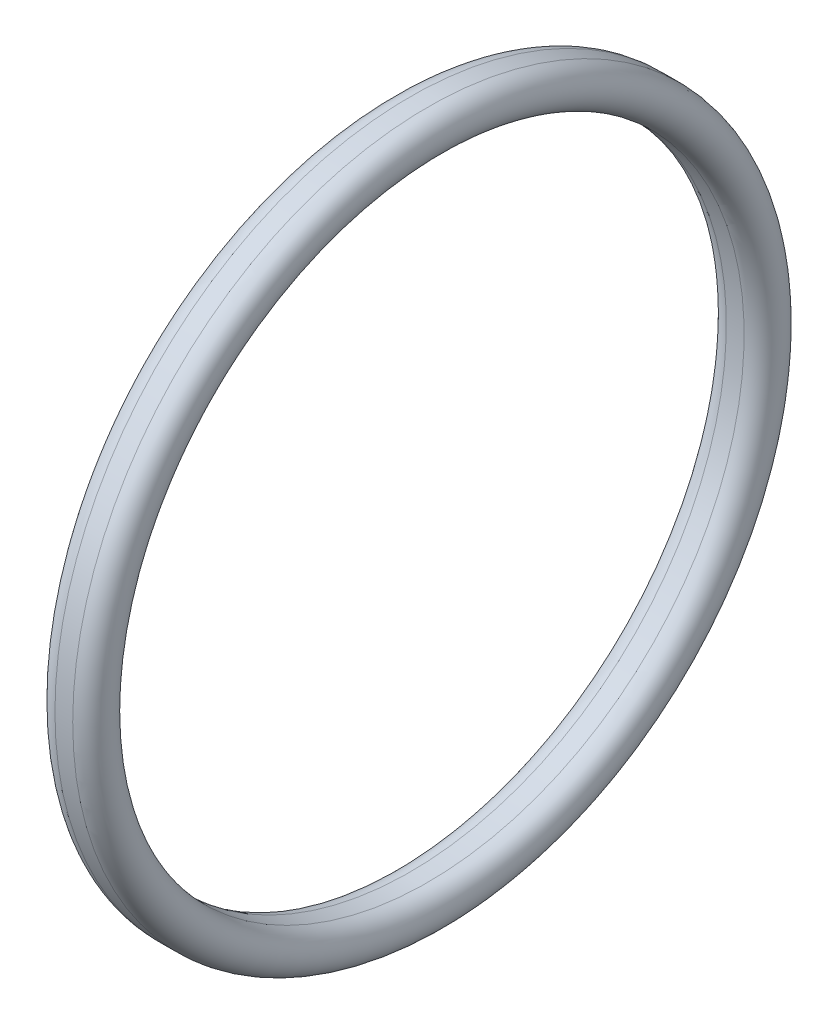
ISO-10303-21;
HEADER;
FILE_DESCRIPTION(('STEP AP214'),'2;1');
FILE_NAME('part.step','',(''),(''),'','','');
FILE_SCHEMA(('AUTOMOTIVE_DESIGN { 1 0 10303 214 1 1 1 1 }'));
ENDSEC;
DATA;
#1=APPLICATION_CONTEXT('core data for automotive mechanical design processes');
#2=APPLICATION_PROTOCOL_DEFINITION('international standard','automotive_design',2000,#1);
#3=PRODUCT_CONTEXT('',#1,'mechanical');
#4=PRODUCT('Part','Part','',(#3));
#5=PRODUCT_RELATED_PRODUCT_CATEGORY('part','',(#4));
#6=PRODUCT_DEFINITION_FORMATION('','',#4);
#7=PRODUCT_DEFINITION_CONTEXT('part definition',#1,'design');
#8=PRODUCT_DEFINITION('design','',#6,#7);
#9=PRODUCT_DEFINITION_SHAPE('','',#8);
#10=(LENGTH_UNIT() NAMED_UNIT(*) SI_UNIT(.MILLI.,.METRE.));
#11=(NAMED_UNIT(*) PLANE_ANGLE_UNIT() SI_UNIT($,.RADIAN.));
#12=(NAMED_UNIT(*) SI_UNIT($,.STERADIAN.) SOLID_ANGLE_UNIT());
#13=UNCERTAINTY_MEASURE_WITH_UNIT(LENGTH_MEASURE(1.E-05),#10,'distance_accuracy_value','');
#14=(GEOMETRIC_REPRESENTATION_CONTEXT(3) GLOBAL_UNCERTAINTY_ASSIGNED_CONTEXT((#13)) GLOBAL_UNIT_ASSIGNED_CONTEXT((#10,
#11,#12)) REPRESENTATION_CONTEXT('',''));
#15=CARTESIAN_POINT('',(0.,0.,0.));
#16=DIRECTION('',(0.,0.,1.));
#17=DIRECTION('',(1.,0.,0.));
#18=AXIS2_PLACEMENT_3D('',#15,#16,#17);
#19=CARTESIAN_POINT('',(-0.635,0.,0.));
#20=DIRECTION('',(-1.,0.,0.));
#21=DIRECTION('',(0.,0.,1.));
#22=AXIS2_PLACEMENT_3D('',#19,#20,#21);
#23=TOROIDAL_SURFACE('',#22,23.98395,1.39065);
#24=CARTESIAN_POINT('',(-0.635,0.,0.));
#25=DIRECTION('',(-1.,0.,0.));
#26=DIRECTION('',(0.,0.,1.));
#27=AXIS2_PLACEMENT_3D('',#24,#25,#26);
#28=CIRCLE('',#27,22.5933);
#29=CARTESIAN_POINT('',(-0.635,0.,22.5933));
#30=VERTEX_POINT('',#29);
#31=EDGE_CURVE('E10',#30,#30,#28,.T.);
#32=ORIENTED_EDGE('',*,*,#31,.F.);
#33=EDGE_LOOP('',(#32));
#34=FACE_BOUND('',#33,.T.);
#35=CARTESIAN_POINT('',(-0.635,0.,0.));
#36=DIRECTION('',(-1.,0.,0.));
#37=DIRECTION('',(0.,0.,1.));
#38=AXIS2_PLACEMENT_3D('',#35,#36,#37);
#39=CIRCLE('',#38,25.3746);
#40=CARTESIAN_POINT('',(-0.635,0.,25.3746));
#41=VERTEX_POINT('',#40);
#42=EDGE_CURVE('E393',#41,#41,#39,.T.);
#43=ORIENTED_EDGE('',*,*,#42,.T.);
#44=EDGE_LOOP('',(#43));
#45=FACE_BOUND('',#44,.T.);
#46=ADVANCED_FACE('F379',(#34,#45),#23,.T.);
#47=CARTESIAN_POINT('',(0.,0.,0.));
#48=DIRECTION('',(-1.,0.,0.));
#49=DIRECTION('',(0.,0.,1.));
#50=AXIS2_PLACEMENT_3D('',#47,#48,#49);
#51=CYLINDRICAL_SURFACE('',#50,22.5933);
#52=CARTESIAN_POINT('',(0.635,0.,0.));
#53=DIRECTION('',(-1.,0.,0.));
#54=DIRECTION('',(0.,0.,1.));
#55=AXIS2_PLACEMENT_3D('',#52,#53,#54);
#56=CIRCLE('',#55,22.5933);
#57=CARTESIAN_POINT('',(0.635,0.,22.5933));
#58=VERTEX_POINT('',#57);
#59=EDGE_CURVE('E385',#58,#58,#56,.T.);
#60=ORIENTED_EDGE('',*,*,#59,.F.);
#61=EDGE_LOOP('',(#60));
#62=FACE_BOUND('',#61,.T.);
#63=ORIENTED_EDGE('',*,*,#31,.T.);
#64=EDGE_LOOP('',(#63));
#65=FACE_BOUND('',#64,.T.);
#66=ADVANCED_FACE('F408',(#62,#65),#51,.F.);
#67=CARTESIAN_POINT('',(0.635,0.,0.));
#68=DIRECTION('',(-1.,0.,0.));
#69=DIRECTION('',(0.,0.,1.));
#70=AXIS2_PLACEMENT_3D('',#67,#68,#69);
#71=TOROIDAL_SURFACE('',#70,23.98395,1.39065);
#72=CARTESIAN_POINT('',(0.635,0.,0.));
#73=DIRECTION('',(-1.,0.,0.));
#74=DIRECTION('',(0.,0.,1.));
#75=AXIS2_PLACEMENT_3D('',#72,#73,#74);
#76=CIRCLE('',#75,25.3746);
#77=CARTESIAN_POINT('',(0.635,0.,25.3746));
#78=VERTEX_POINT('',#77);
#79=EDGE_CURVE('E389',#78,#78,#76,.T.);
#80=ORIENTED_EDGE('',*,*,#79,.F.);
#81=EDGE_LOOP('',(#80));
#82=FACE_BOUND('',#81,.T.);
#83=ORIENTED_EDGE('',*,*,#59,.T.);
#84=EDGE_LOOP('',(#83));
#85=FACE_BOUND('',#84,.T.);
#86=ADVANCED_FACE('F403',(#82,#85),#71,.T.);
#87=CARTESIAN_POINT('',(0.,0.,0.));
#88=DIRECTION('',(-1.,0.,0.));
#89=DIRECTION('',(0.,0.,1.));
#90=AXIS2_PLACEMENT_3D('',#87,#88,#89);
#91=CYLINDRICAL_SURFACE('',#90,25.3746);
#92=ORIENTED_EDGE('',*,*,#42,.F.);
#93=EDGE_LOOP('',(#92));
#94=FACE_BOUND('',#93,.T.);
#95=ORIENTED_EDGE('',*,*,#79,.T.);
#96=EDGE_LOOP('',(#95));
#97=FACE_BOUND('',#96,.T.);
#98=ADVANCED_FACE('F400',(#94,#97),#91,.T.);
#99=CLOSED_SHELL('',(#46,#66,#86,#98));
#100=MANIFOLD_SOLID_BREP('B2',#99);
#101=ADVANCED_BREP_SHAPE_REPRESENTATION('',(#18,#100),#14);
#102=SHAPE_DEFINITION_REPRESENTATION(#9,#101);
ENDSEC;
END-ISO-10303-21;
